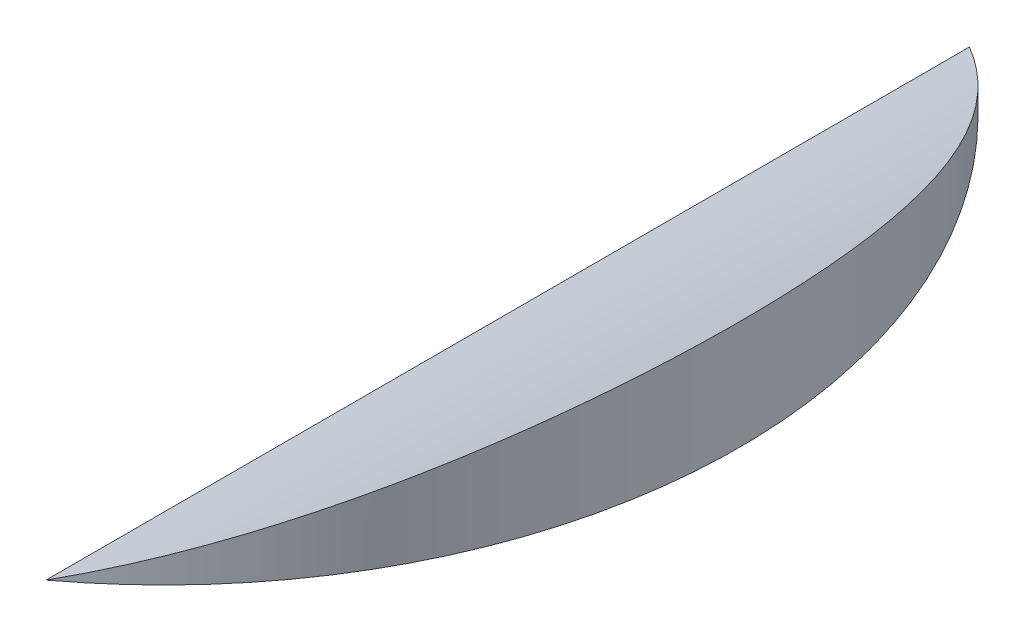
ISO-10303-21;
HEADER;
FILE_DESCRIPTION(('STEP AP214'),'2;1');
FILE_NAME('part.step','',(''),(''),'','','');
FILE_SCHEMA(('AUTOMOTIVE_DESIGN { 1 0 10303 214 1 1 1 1 }'));
ENDSEC;
DATA;
#1=APPLICATION_CONTEXT('core data for automotive mechanical design processes');
#2=APPLICATION_PROTOCOL_DEFINITION('international standard','automotive_design',2000,#1);
#3=PRODUCT_CONTEXT('',#1,'mechanical');
#4=PRODUCT('Part','Part','',(#3));
#5=PRODUCT_RELATED_PRODUCT_CATEGORY('part','',(#4));
#6=PRODUCT_DEFINITION_FORMATION('','',#4);
#7=PRODUCT_DEFINITION_CONTEXT('part definition',#1,'design');
#8=PRODUCT_DEFINITION('design','',#6,#7);
#9=PRODUCT_DEFINITION_SHAPE('','',#8);
#10=(LENGTH_UNIT() NAMED_UNIT(*) SI_UNIT(.MILLI.,.METRE.));
#11=(NAMED_UNIT(*) PLANE_ANGLE_UNIT() SI_UNIT($,.RADIAN.));
#12=(NAMED_UNIT(*) SI_UNIT($,.STERADIAN.) SOLID_ANGLE_UNIT());
#13=UNCERTAINTY_MEASURE_WITH_UNIT(LENGTH_MEASURE(1.E-05),#10,'distance_accuracy_value','');
#14=(GEOMETRIC_REPRESENTATION_CONTEXT(3) GLOBAL_UNCERTAINTY_ASSIGNED_CONTEXT((#13)) GLOBAL_UNIT_ASSIGNED_CONTEXT((#10,
#11,#12)) REPRESENTATION_CONTEXT('',''));
#15=CARTESIAN_POINT('',(0.,0.,0.));
#16=DIRECTION('',(0.,0.,1.));
#17=DIRECTION('',(1.,0.,0.));
#18=AXIS2_PLACEMENT_3D('',#15,#16,#17);
#19=CARTESIAN_POINT('',(-1.747369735,21.874999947,-277.565139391));
#20=DIRECTION('',(0.,-1.,0.));
#21=DIRECTION('',(0.,0.,-1.));
#22=AXIS2_PLACEMENT_3D('',#19,#20,#21);
#23=PLANE('',#22);
#24=DIRECTION('',(0.,0.,-1.));
#25=VECTOR('',#24,1.);
#26=CARTESIAN_POINT('',(-1.74736973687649,21.8749999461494,-238.));
#27=LINE('',#26,#25);
#28=CARTESIAN_POINT('',(-1.7473697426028,21.8749999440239,-282.405988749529));
#29=VERTEX_POINT('',#28);
#30=CARTESIAN_POINT('',(-1.74736973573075,21.8749999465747,-277.594011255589));
#31=VERTEX_POINT('',#30);
#32=EDGE_CURVE('E20',#29,#31,#27,.F.);
#33=ORIENTED_EDGE('',*,*,#32,.F.);
#34=CARTESIAN_POINT('',(-3.539356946,21.874999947,-280.));
#35=DIRECTION('',(0.,-1.,0.));
#36=DIRECTION('',(1.,0.,0.));
#37=AXIS2_PLACEMENT_3D('',#34,#35,#36);
#38=CIRCLE('',#37,3.);
#39=EDGE_CURVE('E15',#29,#31,#38,.T.);
#40=ORIENTED_EDGE('',*,*,#39,.T.);
#41=EDGE_LOOP('',(#33,#40));
#42=FACE_BOUND('',#41,.T.);
#43=ADVANCED_FACE('F12',(#42),#23,.T.);
#44=CARTESIAN_POINT('',(-3.539356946,22.445726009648,-280.));
#45=DIRECTION('',(0.,-1.,0.));
#46=DIRECTION('',(1.,0.,0.));
#47=AXIS2_PLACEMENT_3D('',#44,#45,#46);
#48=CYLINDRICAL_SURFACE('',#47,3.);
#49=ORIENTED_EDGE('',*,*,#39,.F.);
#50=CARTESIAN_POINT('',(-1.74736974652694,21.874999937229,-277.594011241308));
#51=CARTESIAN_POINT('',(-1.67884486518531,21.900432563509,-277.645055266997));
#52=CARTESIAN_POINT('',(-1.61258360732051,21.9260996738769,-277.698952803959));
#53=CARTESIAN_POINT('',(-1.48487593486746,21.9774108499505,-277.812215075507));
#54=CARTESIAN_POINT('',(-1.42343048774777,22.0030549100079,-277.871580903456));
#55=CARTESIAN_POINT('',(-1.24628467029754,22.0794161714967,-278.05801962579));
#56=CARTESIAN_POINT('',(-1.13836764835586,22.1293358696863,-278.192992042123));
#57=CARTESIAN_POINT('',(-0.946227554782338,22.2224422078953,-278.481533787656));
#58=CARTESIAN_POINT('',(-0.862054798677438,22.2656144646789,-278.635141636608));
#59=CARTESIAN_POINT('',(-0.756379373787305,22.3214961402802,-278.876279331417));
#60=CARTESIAN_POINT('',(-0.724595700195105,22.338637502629,-278.958402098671));
#61=CARTESIAN_POINT('',(-0.668229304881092,22.3694242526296,-279.125699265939));
#62=CARTESIAN_POINT('',(-0.643642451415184,22.383071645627,-279.210871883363));
#63=CARTESIAN_POINT('',(-0.603651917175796,22.4054632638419,-279.376827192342));
#64=CARTESIAN_POINT('',(-0.587681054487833,22.4145071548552,-279.457433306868));
#65=CARTESIAN_POINT('',(-0.562389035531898,22.4288974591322,-279.619971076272));
#66=CARTESIAN_POINT('',(-0.553064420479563,22.4342457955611,-279.701902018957));
#67=CARTESIAN_POINT('',(-0.541198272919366,22.4410601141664,-279.866422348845));
#68=CARTESIAN_POINT('',(-0.538656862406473,22.442526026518,-279.949011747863));
#69=CARTESIAN_POINT('',(-0.540388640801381,22.4415302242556,-280.114069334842));
#70=CARTESIAN_POINT('',(-0.544661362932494,22.4390687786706,-280.196537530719));
#71=CARTESIAN_POINT('',(-0.566033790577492,22.4268092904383,-280.425505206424));
#72=CARTESIAN_POINT('',(-0.590596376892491,22.4127536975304,-280.571162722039));
#73=CARTESIAN_POINT('',(-0.660279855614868,22.3737769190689,-280.855830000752));
#74=CARTESIAN_POINT('',(-0.705403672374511,22.3488541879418,-280.994838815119));
#75=CARTESIAN_POINT('',(-0.816367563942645,22.2895421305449,-281.267994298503));
#76=CARTESIAN_POINT('',(-0.882873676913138,22.2548536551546,-281.401803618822));
#77=CARTESIAN_POINT('',(-1.03402647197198,22.1794084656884,-281.656901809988));
#78=CARTESIAN_POINT('',(-1.118682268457,22.1386487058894,-281.77818434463));
#79=CARTESIAN_POINT('',(-1.28996999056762,22.0605261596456,-281.988913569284));
#80=CARTESIAN_POINT('',(-1.37432112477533,22.0235967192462,-282.080392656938));
#81=CARTESIAN_POINT('',(-1.55334797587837,21.9492653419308,-282.251907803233));
#82=CARTESIAN_POINT('',(-1.64799869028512,21.9118647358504,-282.331970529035));
#83=CARTESIAN_POINT('',(-1.74736975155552,21.8749999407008,-282.405988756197));
#84=B_SPLINE_CURVE_WITH_KNOTS('',3,(#50,#51,#52,#53,#54,#55,#56,#57,#58,#59,#60,#61,#62,#63,#64,
#65,#66,#67,#68,#69,#70,#71,#72,#73,#74,#75,#76,#77,#78,#79,#80,#81,#82,#83),.UNSPECIFIED.,.F.,
.F.,(4,2,2,2,2,2,2,2,2,2,2,2,2,2,2,2,4),(0.,0.267301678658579,0.534656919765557,
1.07165902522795,1.60979066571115,1.87858548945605,2.14722569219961,2.3948877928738,
2.64242091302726,2.88995848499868,3.13747910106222,3.58038504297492,4.02335399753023,
4.48173220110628,4.94034113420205,5.32883660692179,5.71640919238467),.UNSPECIFIED.);
#85=EDGE_CURVE('E9',#31,#29,#84,.T.);
#86=ORIENTED_EDGE('',*,*,#85,.F.);
#87=EDGE_LOOP('',(#49,#86));
#88=FACE_BOUND('',#87,.T.);
#89=ADVANCED_FACE('F29',(#88),#48,.T.);
#90=CARTESIAN_POINT('',(-4.531251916,29.374999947,-277.5651393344));
#91=DIRECTION('',(0.,0.,-1.));
#92=DIRECTION('',(-1.,0.,0.));
#93=AXIS2_PLACEMENT_3D('',#90,#91,#92);
#94=CYLINDRICAL_SURFACE('',#93,8.);
#95=ORIENTED_EDGE('',*,*,#32,.T.);
#96=ORIENTED_EDGE('',*,*,#85,.T.);
#97=EDGE_LOOP('',(#95,#96));
#98=FACE_BOUND('',#97,.T.);
#99=ADVANCED_FACE('F31',(#98),#94,.F.);
#100=CLOSED_SHELL('',(#43,#89,#99));
#101=MANIFOLD_SOLID_BREP('B1',#100);
#102=ADVANCED_BREP_SHAPE_REPRESENTATION('',(#18,#101),#14);
#103=SHAPE_DEFINITION_REPRESENTATION(#9,#102);
ENDSEC;
END-ISO-10303-21;
